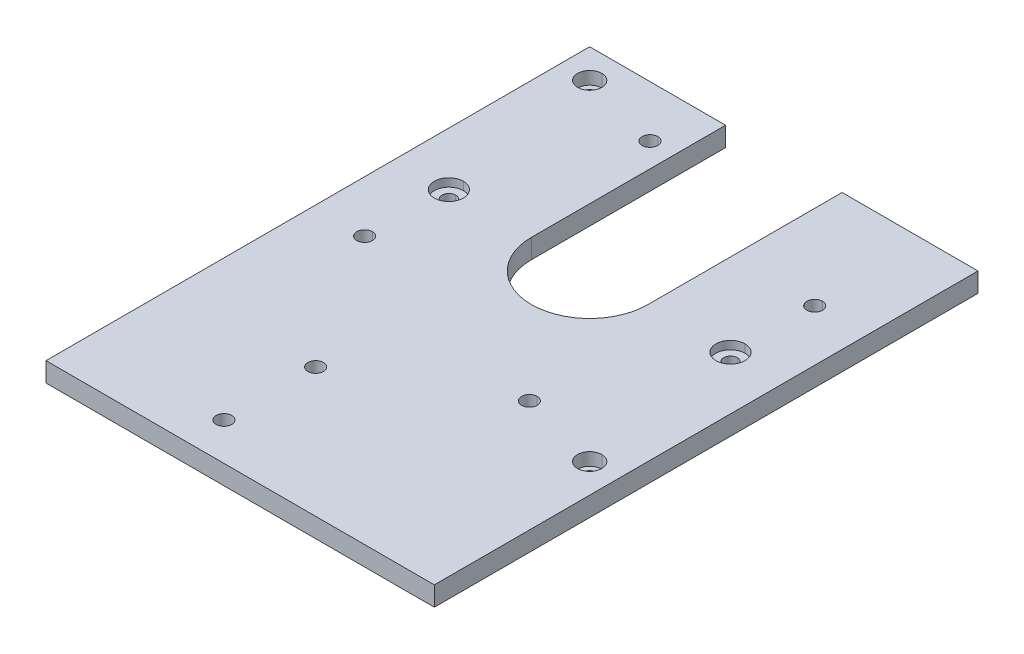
ISO-10303-21;
HEADER;
FILE_DESCRIPTION(('STEP AP214'),'2;1');
FILE_NAME('part.step','',(''),(''),'','','');
FILE_SCHEMA(('AUTOMOTIVE_DESIGN { 1 0 10303 214 1 1 1 1 }'));
ENDSEC;
DATA;
#1=APPLICATION_CONTEXT('core data for automotive mechanical design processes');
#2=APPLICATION_PROTOCOL_DEFINITION('international standard','automotive_design',2000,#1);
#3=PRODUCT_CONTEXT('',#1,'mechanical');
#4=PRODUCT('Part','Part','',(#3));
#5=PRODUCT_RELATED_PRODUCT_CATEGORY('part','',(#4));
#6=PRODUCT_DEFINITION_FORMATION('','',#4);
#7=PRODUCT_DEFINITION_CONTEXT('part definition',#1,'design');
#8=PRODUCT_DEFINITION('design','',#6,#7);
#9=PRODUCT_DEFINITION_SHAPE('','',#8);
#10=(LENGTH_UNIT() NAMED_UNIT(*) SI_UNIT(.MILLI.,.METRE.));
#11=(NAMED_UNIT(*) PLANE_ANGLE_UNIT() SI_UNIT($,.RADIAN.));
#12=(NAMED_UNIT(*) SI_UNIT($,.STERADIAN.) SOLID_ANGLE_UNIT());
#13=UNCERTAINTY_MEASURE_WITH_UNIT(LENGTH_MEASURE(1.E-05),#10,'distance_accuracy_value','');
#14=(GEOMETRIC_REPRESENTATION_CONTEXT(3) GLOBAL_UNCERTAINTY_ASSIGNED_CONTEXT((#13)) GLOBAL_UNIT_ASSIGNED_CONTEXT((#10,
#11,#12)) REPRESENTATION_CONTEXT('',''));
#15=CARTESIAN_POINT('',(0.,0.,0.));
#16=DIRECTION('',(0.,0.,1.));
#17=DIRECTION('',(1.,0.,0.));
#18=AXIS2_PLACEMENT_3D('',#15,#16,#17);
#19=CARTESIAN_POINT('',(48.2981,3.683,0.));
#20=DIRECTION('',(0.,-1.,0.));
#21=DIRECTION('',(0.,0.,-1.));
#22=AXIS2_PLACEMENT_3D('',#19,#20,#21);
#23=PLANE('',#22);
#24=CARTESIAN_POINT('',(46.0502,3.683,0.));
#25=DIRECTION('',(0.,1.,0.));
#26=DIRECTION('',(0.,0.,1.));
#27=AXIS2_PLACEMENT_3D('',#24,#25,#26);
#28=CIRCLE('',#27,4.7625);
#29=CARTESIAN_POINT('',(46.0502,3.683,4.7625));
#30=VERTEX_POINT('',#29);
#31=CARTESIAN_POINT('',(46.0502,3.683,-4.7625));
#32=VERTEX_POINT('',#31);
#33=EDGE_CURVE('E567',#30,#32,#28,.T.);
#34=ORIENTED_EDGE('',*,*,#33,.T.);
#35=CARTESIAN_POINT('',(46.0502,3.683,0.));
#36=DIRECTION('',(0.,1.,0.));
#37=DIRECTION('',(0.,0.,1.));
#38=AXIS2_PLACEMENT_3D('',#35,#36,#37);
#39=CIRCLE('',#38,4.7625);
#40=EDGE_CURVE('E435',#32,#30,#39,.T.);
#41=ORIENTED_EDGE('',*,*,#40,.T.);
#42=EDGE_LOOP('',(#34,#41));
#43=FACE_BOUND('',#42,.T.);
#44=CARTESIAN_POINT('',(46.0502,3.683,0.));
#45=DIRECTION('',(0.,1.,0.));
#46=DIRECTION('',(0.,0.,1.));
#47=AXIS2_PLACEMENT_3D('',#44,#45,#46);
#48=CIRCLE('',#47,2.2479);
#49=CARTESIAN_POINT('',(46.0502,3.683,2.2479));
#50=VERTEX_POINT('',#49);
#51=CARTESIAN_POINT('',(46.0502,3.683,-2.2479));
#52=VERTEX_POINT('',#51);
#53=EDGE_CURVE('E9',#50,#52,#48,.T.);
#54=ORIENTED_EDGE('',*,*,#53,.F.);
#55=CARTESIAN_POINT('',(46.0502,3.683,0.));
#56=DIRECTION('',(0.,1.,0.));
#57=DIRECTION('',(0.,0.,1.));
#58=AXIS2_PLACEMENT_3D('',#55,#56,#57);
#59=CIRCLE('',#58,2.2479);
#60=EDGE_CURVE('E18',#52,#50,#59,.T.);
#61=ORIENTED_EDGE('',*,*,#60,.F.);
#62=EDGE_LOOP('',(#54,#61));
#63=FACE_BOUND('',#62,.T.);
#64=ADVANCED_FACE('F14',(#43,#63),#23,.F.);
#65=CARTESIAN_POINT('',(56.2229,2.1844,53.975));
#66=DIRECTION('',(0.,-1.,0.));
#67=DIRECTION('',(0.,0.,-1.));
#68=AXIS2_PLACEMENT_3D('',#65,#66,#67);
#69=PLANE('',#68);
#70=CARTESIAN_POINT('',(53.975,2.1844,53.975));
#71=DIRECTION('',(0.,1.,0.));
#72=DIRECTION('',(0.,0.,1.));
#73=AXIS2_PLACEMENT_3D('',#70,#71,#72);
#74=CIRCLE('',#73,3.96875);
#75=CARTESIAN_POINT('',(53.975,2.1844,57.94375));
#76=VERTEX_POINT('',#75);
#77=CARTESIAN_POINT('',(53.975,2.1844,50.00625));
#78=VERTEX_POINT('',#77);
#79=EDGE_CURVE('E434',#76,#78,#74,.T.);
#80=ORIENTED_EDGE('',*,*,#79,.T.);
#81=CARTESIAN_POINT('',(53.975,2.1844,53.975));
#82=DIRECTION('',(0.,1.,0.));
#83=DIRECTION('',(0.,0.,1.));
#84=AXIS2_PLACEMENT_3D('',#81,#82,#83);
#85=CIRCLE('',#84,3.96875);
#86=EDGE_CURVE('E433',#78,#76,#85,.T.);
#87=ORIENTED_EDGE('',*,*,#86,.T.);
#88=EDGE_LOOP('',(#80,#87));
#89=FACE_BOUND('',#88,.T.);
#90=CARTESIAN_POINT('',(53.975,2.1844,53.975));
#91=DIRECTION('',(0.,1.,0.));
#92=DIRECTION('',(0.,0.,1.));
#93=AXIS2_PLACEMENT_3D('',#90,#91,#92);
#94=CIRCLE('',#93,2.2479);
#95=CARTESIAN_POINT('',(53.975,2.1844,56.2229));
#96=VERTEX_POINT('',#95);
#97=CARTESIAN_POINT('',(53.975,2.1844,51.7271));
#98=VERTEX_POINT('',#97);
#99=EDGE_CURVE('E339',#96,#98,#94,.T.);
#100=ORIENTED_EDGE('',*,*,#99,.F.);
#101=CARTESIAN_POINT('',(53.975,2.1844,53.975));
#102=DIRECTION('',(0.,1.,0.));
#103=DIRECTION('',(0.,0.,1.));
#104=AXIS2_PLACEMENT_3D('',#101,#102,#103);
#105=CIRCLE('',#104,2.2479);
#106=EDGE_CURVE('E355',#98,#96,#105,.T.);
#107=ORIENTED_EDGE('',*,*,#106,.F.);
#108=EDGE_LOOP('',(#100,#107));
#109=FACE_BOUND('',#108,.T.);
#110=ADVANCED_FACE('F16',(#89,#109),#69,.F.);
#111=CARTESIAN_POINT('',(-51.7271,2.1844,-53.975));
#112=DIRECTION('',(0.,-1.,0.));
#113=DIRECTION('',(0.,0.,-1.));
#114=AXIS2_PLACEMENT_3D('',#111,#112,#113);
#115=PLANE('',#114);
#116=CARTESIAN_POINT('',(-53.975,2.1844,-53.975));
#117=DIRECTION('',(0.,1.,0.));
#118=DIRECTION('',(0.,0.,1.));
#119=AXIS2_PLACEMENT_3D('',#116,#117,#118);
#120=CIRCLE('',#119,3.96875);
#121=CARTESIAN_POINT('',(-53.975,2.1844,-50.00625));
#122=VERTEX_POINT('',#121);
#123=CARTESIAN_POINT('',(-53.975,2.1844,-57.94375));
#124=VERTEX_POINT('',#123);
#125=EDGE_CURVE('E372',#122,#124,#120,.T.);
#126=ORIENTED_EDGE('',*,*,#125,.T.);
#127=CARTESIAN_POINT('',(-53.975,2.1844,-53.975));
#128=DIRECTION('',(0.,1.,0.));
#129=DIRECTION('',(0.,0.,1.));
#130=AXIS2_PLACEMENT_3D('',#127,#128,#129);
#131=CIRCLE('',#130,3.96875);
#132=EDGE_CURVE('E475',#124,#122,#131,.T.);
#133=ORIENTED_EDGE('',*,*,#132,.T.);
#134=EDGE_LOOP('',(#126,#133));
#135=FACE_BOUND('',#134,.T.);
#136=CARTESIAN_POINT('',(-53.975,2.1844,-53.975));
#137=DIRECTION('',(0.,1.,0.));
#138=DIRECTION('',(0.,0.,1.));
#139=AXIS2_PLACEMENT_3D('',#136,#137,#138);
#140=CIRCLE('',#139,2.2479);
#141=CARTESIAN_POINT('',(-53.975,2.1844,-51.7271));
#142=VERTEX_POINT('',#141);
#143=CARTESIAN_POINT('',(-53.975,2.1844,-56.2229));
#144=VERTEX_POINT('',#143);
#145=EDGE_CURVE('E402',#142,#144,#140,.T.);
#146=ORIENTED_EDGE('',*,*,#145,.F.);
#147=CARTESIAN_POINT('',(-53.975,2.1844,-53.975));
#148=DIRECTION('',(0.,1.,0.));
#149=DIRECTION('',(0.,0.,1.));
#150=AXIS2_PLACEMENT_3D('',#147,#148,#149);
#151=CIRCLE('',#150,2.2479);
#152=EDGE_CURVE('E508',#144,#142,#151,.T.);
#153=ORIENTED_EDGE('',*,*,#152,.F.);
#154=EDGE_LOOP('',(#146,#153));
#155=FACE_BOUND('',#154,.T.);
#156=ADVANCED_FACE('F1135',(#135,#155),#115,.F.);
#157=CARTESIAN_POINT('',(-43.8023,3.683,0.));
#158=DIRECTION('',(0.,-1.,0.));
#159=DIRECTION('',(0.,0.,-1.));
#160=AXIS2_PLACEMENT_3D('',#157,#158,#159);
#161=PLANE('',#160);
#162=CARTESIAN_POINT('',(-46.0502,3.683,0.));
#163=DIRECTION('',(0.,1.,0.));
#164=DIRECTION('',(0.,0.,1.));
#165=AXIS2_PLACEMENT_3D('',#162,#163,#164);
#166=CIRCLE('',#165,4.7625);
#167=CARTESIAN_POINT('',(-46.0502,3.683,4.7625));
#168=VERTEX_POINT('',#167);
#169=CARTESIAN_POINT('',(-46.0502,3.683,-4.7625));
#170=VERTEX_POINT('',#169);
#171=EDGE_CURVE('E300',#168,#170,#166,.T.);
#172=ORIENTED_EDGE('',*,*,#171,.T.);
#173=CARTESIAN_POINT('',(-46.0502,3.683,0.));
#174=DIRECTION('',(0.,1.,0.));
#175=DIRECTION('',(0.,0.,1.));
#176=AXIS2_PLACEMENT_3D('',#173,#174,#175);
#177=CIRCLE('',#176,4.7625);
#178=EDGE_CURVE('E295',#170,#168,#177,.T.);
#179=ORIENTED_EDGE('',*,*,#178,.T.);
#180=EDGE_LOOP('',(#172,#179));
#181=FACE_BOUND('',#180,.T.);
#182=CARTESIAN_POINT('',(-46.0502,3.683,0.));
#183=DIRECTION('',(0.,1.,0.));
#184=DIRECTION('',(0.,0.,1.));
#185=AXIS2_PLACEMENT_3D('',#182,#183,#184);
#186=CIRCLE('',#185,2.2479);
#187=CARTESIAN_POINT('',(-46.0502,3.683,2.2479));
#188=VERTEX_POINT('',#187);
#189=CARTESIAN_POINT('',(-46.0502,3.683,-2.2479));
#190=VERTEX_POINT('',#189);
#191=EDGE_CURVE('E509',#188,#190,#186,.T.);
#192=ORIENTED_EDGE('',*,*,#191,.F.);
#193=CARTESIAN_POINT('',(-46.0502,3.683,0.));
#194=DIRECTION('',(0.,1.,0.));
#195=DIRECTION('',(0.,0.,1.));
#196=AXIS2_PLACEMENT_3D('',#193,#194,#195);
#197=CIRCLE('',#196,2.2479);
#198=EDGE_CURVE('E534',#190,#188,#197,.T.);
#199=ORIENTED_EDGE('',*,*,#198,.F.);
#200=EDGE_LOOP('',(#192,#199));
#201=FACE_BOUND('',#200,.T.);
#202=ADVANCED_FACE('F297',(#181,#201),#161,.F.);
#203=CARTESIAN_POINT('',(46.0502,6.35,0.));
#204=DIRECTION('',(0.,1.,0.));
#205=DIRECTION('',(0.,0.,1.));
#206=AXIS2_PLACEMENT_3D('',#203,#204,#205);
#207=CYLINDRICAL_SURFACE('',#206,2.2479);
#208=DIRECTION('',(0.,1.,0.));
#209=VECTOR('',#208,1.);
#210=CARTESIAN_POINT('',(46.0502,6.35,-2.2479));
#211=LINE('',#210,#209);
#212=CARTESIAN_POINT('',(46.0502,0.,-2.2479));
#213=VERTEX_POINT('',#212);
#214=EDGE_CURVE('E335',#213,#52,#211,.T.);
#215=ORIENTED_EDGE('',*,*,#214,.F.);
#216=CARTESIAN_POINT('',(46.0502,0.,0.));
#217=DIRECTION('',(0.,-1.,0.));
#218=DIRECTION('',(0.,0.,-1.));
#219=AXIS2_PLACEMENT_3D('',#216,#217,#218);
#220=CIRCLE('',#219,2.2479);
#221=CARTESIAN_POINT('',(46.0502,0.,2.2479));
#222=VERTEX_POINT('',#221);
#223=EDGE_CURVE('E392',#213,#222,#220,.T.);
#224=ORIENTED_EDGE('',*,*,#223,.T.);
#225=DIRECTION('',(0.,1.,0.));
#226=VECTOR('',#225,1.);
#227=CARTESIAN_POINT('',(46.0502,6.35,2.2479));
#228=LINE('',#227,#226);
#229=EDGE_CURVE('E25',#222,#50,#228,.T.);
#230=ORIENTED_EDGE('',*,*,#229,.T.);
#231=ORIENTED_EDGE('',*,*,#53,.T.);
#232=EDGE_LOOP('',(#215,#224,#230,#231));
#233=FACE_BOUND('',#232,.T.);
#234=ADVANCED_FACE('F1163',(#233),#207,.F.);
#235=CARTESIAN_POINT('',(46.0502,6.35,0.));
#236=DIRECTION('',(0.,1.,0.));
#237=DIRECTION('',(0.,0.,1.));
#238=AXIS2_PLACEMENT_3D('',#235,#236,#237);
#239=CYLINDRICAL_SURFACE('',#238,2.2479);
#240=CARTESIAN_POINT('',(46.0502,0.,0.));
#241=DIRECTION('',(0.,-1.,0.));
#242=DIRECTION('',(0.,0.,-1.));
#243=AXIS2_PLACEMENT_3D('',#240,#241,#242);
#244=CIRCLE('',#243,2.2479);
#245=EDGE_CURVE('E397',#222,#213,#244,.T.);
#246=ORIENTED_EDGE('',*,*,#245,.T.);
#247=ORIENTED_EDGE('',*,*,#214,.T.);
#248=ORIENTED_EDGE('',*,*,#60,.T.);
#249=ORIENTED_EDGE('',*,*,#229,.F.);
#250=EDGE_LOOP('',(#246,#247,#248,#249));
#251=FACE_BOUND('',#250,.T.);
#252=ADVANCED_FACE('F1157',(#251),#239,.F.);
#253=CARTESIAN_POINT('',(53.975,6.35,53.975));
#254=DIRECTION('',(0.,1.,0.));
#255=DIRECTION('',(0.,0.,1.));
#256=AXIS2_PLACEMENT_3D('',#253,#254,#255);
#257=CYLINDRICAL_SURFACE('',#256,2.2479);
#258=DIRECTION('',(0.,1.,0.));
#259=VECTOR('',#258,1.);
#260=CARTESIAN_POINT('',(53.975,6.35,51.7271));
#261=LINE('',#260,#259);
#262=CARTESIAN_POINT('',(53.975,0.,51.7271));
#263=VERTEX_POINT('',#262);
#264=EDGE_CURVE('E398',#263,#98,#261,.T.);
#265=ORIENTED_EDGE('',*,*,#264,.F.);
#266=CARTESIAN_POINT('',(53.975,0.,53.975));
#267=DIRECTION('',(0.,-1.,0.));
#268=DIRECTION('',(0.,0.,-1.));
#269=AXIS2_PLACEMENT_3D('',#266,#267,#268);
#270=CIRCLE('',#269,2.2479);
#271=CARTESIAN_POINT('',(53.975,0.,56.2229));
#272=VERTEX_POINT('',#271);
#273=EDGE_CURVE('E518',#263,#272,#270,.T.);
#274=ORIENTED_EDGE('',*,*,#273,.T.);
#275=DIRECTION('',(0.,1.,0.));
#276=VECTOR('',#275,1.);
#277=CARTESIAN_POINT('',(53.975,6.35,56.2229));
#278=LINE('',#277,#276);
#279=EDGE_CURVE('E352',#272,#96,#278,.T.);
#280=ORIENTED_EDGE('',*,*,#279,.T.);
#281=ORIENTED_EDGE('',*,*,#99,.T.);
#282=EDGE_LOOP('',(#265,#274,#280,#281));
#283=FACE_BOUND('',#282,.T.);
#284=ADVANCED_FACE('F1162',(#283),#257,.F.);
#285=CARTESIAN_POINT('',(53.975,6.35,53.975));
#286=DIRECTION('',(0.,1.,0.));
#287=DIRECTION('',(0.,0.,1.));
#288=AXIS2_PLACEMENT_3D('',#285,#286,#287);
#289=CYLINDRICAL_SURFACE('',#288,2.2479);
#290=CARTESIAN_POINT('',(53.975,0.,53.975));
#291=DIRECTION('',(0.,-1.,0.));
#292=DIRECTION('',(0.,0.,-1.));
#293=AXIS2_PLACEMENT_3D('',#290,#291,#292);
#294=CIRCLE('',#293,2.2479);
#295=EDGE_CURVE('E385',#272,#263,#294,.T.);
#296=ORIENTED_EDGE('',*,*,#295,.T.);
#297=ORIENTED_EDGE('',*,*,#264,.T.);
#298=ORIENTED_EDGE('',*,*,#106,.T.);
#299=ORIENTED_EDGE('',*,*,#279,.F.);
#300=EDGE_LOOP('',(#296,#297,#298,#299));
#301=FACE_BOUND('',#300,.T.);
#302=ADVANCED_FACE('F1309',(#301),#289,.F.);
#303=CARTESIAN_POINT('',(-53.975,6.35,-53.975));
#304=DIRECTION('',(0.,1.,0.));
#305=DIRECTION('',(0.,0.,1.));
#306=AXIS2_PLACEMENT_3D('',#303,#304,#305);
#307=CYLINDRICAL_SURFACE('',#306,2.2479);
#308=DIRECTION('',(0.,1.,0.));
#309=VECTOR('',#308,1.);
#310=CARTESIAN_POINT('',(-53.975,6.35,-56.2229));
#311=LINE('',#310,#309);
#312=CARTESIAN_POINT('',(-53.975,0.,-56.2229));
#313=VERTEX_POINT('',#312);
#314=EDGE_CURVE('E504',#313,#144,#311,.T.);
#315=ORIENTED_EDGE('',*,*,#314,.F.);
#316=CARTESIAN_POINT('',(-53.975,0.,-53.975));
#317=DIRECTION('',(0.,-1.,0.));
#318=DIRECTION('',(0.,0.,-1.));
#319=AXIS2_PLACEMENT_3D('',#316,#317,#318);
#320=CIRCLE('',#319,2.2479);
#321=CARTESIAN_POINT('',(-53.975,0.,-51.7271));
#322=VERTEX_POINT('',#321);
#323=EDGE_CURVE('E386',#313,#322,#320,.T.);
#324=ORIENTED_EDGE('',*,*,#323,.T.);
#325=DIRECTION('',(0.,1.,0.));
#326=VECTOR('',#325,1.);
#327=CARTESIAN_POINT('',(-53.975,6.35,-51.7271));
#328=LINE('',#327,#326);
#329=EDGE_CURVE('E556',#322,#142,#328,.T.);
#330=ORIENTED_EDGE('',*,*,#329,.T.);
#331=ORIENTED_EDGE('',*,*,#145,.T.);
#332=EDGE_LOOP('',(#315,#324,#330,#331));
#333=FACE_BOUND('',#332,.T.);
#334=ADVANCED_FACE('F1050',(#333),#307,.F.);
#335=CARTESIAN_POINT('',(-53.975,6.35,-53.975));
#336=DIRECTION('',(0.,1.,0.));
#337=DIRECTION('',(0.,0.,1.));
#338=AXIS2_PLACEMENT_3D('',#335,#336,#337);
#339=CYLINDRICAL_SURFACE('',#338,2.2479);
#340=CARTESIAN_POINT('',(-53.975,0.,-53.975));
#341=DIRECTION('',(0.,-1.,0.));
#342=DIRECTION('',(0.,0.,-1.));
#343=AXIS2_PLACEMENT_3D('',#340,#341,#342);
#344=CIRCLE('',#343,2.2479);
#345=EDGE_CURVE('E391',#322,#313,#344,.T.);
#346=ORIENTED_EDGE('',*,*,#345,.T.);
#347=ORIENTED_EDGE('',*,*,#314,.T.);
#348=ORIENTED_EDGE('',*,*,#152,.T.);
#349=ORIENTED_EDGE('',*,*,#329,.F.);
#350=EDGE_LOOP('',(#346,#347,#348,#349));
#351=FACE_BOUND('',#350,.T.);
#352=ADVANCED_FACE('F1045',(#351),#339,.F.);
#353=CARTESIAN_POINT('',(-46.0502,6.35,0.));
#354=DIRECTION('',(0.,1.,0.));
#355=DIRECTION('',(0.,0.,1.));
#356=AXIS2_PLACEMENT_3D('',#353,#354,#355);
#357=CYLINDRICAL_SURFACE('',#356,2.2479);
#358=DIRECTION('',(0.,1.,0.));
#359=VECTOR('',#358,1.);
#360=CARTESIAN_POINT('',(-46.0502,6.35,-2.2479));
#361=LINE('',#360,#359);
#362=CARTESIAN_POINT('',(-46.0502,0.,-2.2479));
#363=VERTEX_POINT('',#362);
#364=EDGE_CURVE('E588',#363,#190,#361,.T.);
#365=ORIENTED_EDGE('',*,*,#364,.F.);
#366=CARTESIAN_POINT('',(-46.0502,0.,0.));
#367=DIRECTION('',(0.,-1.,0.));
#368=DIRECTION('',(0.,0.,-1.));
#369=AXIS2_PLACEMENT_3D('',#366,#367,#368);
#370=CIRCLE('',#369,2.2479);
#371=CARTESIAN_POINT('',(-46.0502,0.,2.2479));
#372=VERTEX_POINT('',#371);
#373=EDGE_CURVE('E486',#363,#372,#370,.T.);
#374=ORIENTED_EDGE('',*,*,#373,.T.);
#375=DIRECTION('',(0.,1.,0.));
#376=VECTOR('',#375,1.);
#377=CARTESIAN_POINT('',(-46.0502,6.35,2.2479));
#378=LINE('',#377,#376);
#379=EDGE_CURVE('E530',#372,#188,#378,.T.);
#380=ORIENTED_EDGE('',*,*,#379,.T.);
#381=ORIENTED_EDGE('',*,*,#191,.T.);
#382=EDGE_LOOP('',(#365,#374,#380,#381));
#383=FACE_BOUND('',#382,.T.);
#384=ADVANCED_FACE('F1036',(#383),#357,.F.);
#385=CARTESIAN_POINT('',(-46.0502,6.35,0.));
#386=DIRECTION('',(0.,1.,0.));
#387=DIRECTION('',(0.,0.,1.));
#388=AXIS2_PLACEMENT_3D('',#385,#386,#387);
#389=CYLINDRICAL_SURFACE('',#388,2.2479);
#390=CARTESIAN_POINT('',(-46.0502,0.,0.));
#391=DIRECTION('',(0.,-1.,0.));
#392=DIRECTION('',(0.,0.,-1.));
#393=AXIS2_PLACEMENT_3D('',#390,#391,#392);
#394=CIRCLE('',#393,2.2479);
#395=EDGE_CURVE('E482',#372,#363,#394,.T.);
#396=ORIENTED_EDGE('',*,*,#395,.T.);
#397=ORIENTED_EDGE('',*,*,#364,.T.);
#398=ORIENTED_EDGE('',*,*,#198,.T.);
#399=ORIENTED_EDGE('',*,*,#379,.F.);
#400=EDGE_LOOP('',(#396,#397,#398,#399));
#401=FACE_BOUND('',#400,.T.);
#402=ADVANCED_FACE('F1030',(#401),#389,.F.);
#403=CARTESIAN_POINT('',(46.662331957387,6.35,-26.94050991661));
#404=DIRECTION('',(0.,1.,0.));
#405=DIRECTION('',(0.,0.,1.));
#406=AXIS2_PLACEMENT_3D('',#403,#404,#405);
#407=CYLINDRICAL_SURFACE('',#406,2.5527);
#408=CARTESIAN_POINT('',(46.662331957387,0.,-26.94050991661));
#409=DIRECTION('',(0.,-1.,0.));
#410=DIRECTION('',(0.,0.,-1.));
#411=AXIS2_PLACEMENT_3D('',#408,#409,#410);
#412=CIRCLE('',#411,2.5527);
#413=CARTESIAN_POINT('',(46.662331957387,0.,-24.38780991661));
#414=VERTEX_POINT('',#413);
#415=CARTESIAN_POINT('',(46.662331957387,0.,-29.49320991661));
#416=VERTEX_POINT('',#415);
#417=EDGE_CURVE('E396',#414,#416,#412,.T.);
#418=ORIENTED_EDGE('',*,*,#417,.T.);
#419=DIRECTION('',(0.,1.,0.));
#420=VECTOR('',#419,1.);
#421=CARTESIAN_POINT('',(46.662331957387,6.35,-29.49320991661));
#422=LINE('',#421,#420);
#423=CARTESIAN_POINT('',(46.662331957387,6.35,-29.49320991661));
#424=VERTEX_POINT('',#423);
#425=EDGE_CURVE('E439',#416,#424,#422,.T.);
#426=ORIENTED_EDGE('',*,*,#425,.T.);
#427=CARTESIAN_POINT('',(46.662331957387,6.35,-26.94050991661));
#428=DIRECTION('',(0.,1.,0.));
#429=DIRECTION('',(0.,0.,1.));
#430=AXIS2_PLACEMENT_3D('',#427,#428,#429);
#431=CIRCLE('',#430,2.5527);
#432=CARTESIAN_POINT('',(46.662331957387,6.35,-24.38780991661));
#433=VERTEX_POINT('',#432);
#434=EDGE_CURVE('E553',#424,#433,#431,.T.);
#435=ORIENTED_EDGE('',*,*,#434,.T.);
#436=DIRECTION('',(0.,1.,0.));
#437=VECTOR('',#436,1.);
#438=CARTESIAN_POINT('',(46.662331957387,6.35,-24.38780991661));
#439=LINE('',#438,#437);
#440=EDGE_CURVE('E503',#414,#433,#439,.T.);
#441=ORIENTED_EDGE('',*,*,#440,.F.);
#442=EDGE_LOOP('',(#418,#426,#435,#441));
#443=FACE_BOUND('',#442,.T.);
#444=ADVANCED_FACE('F1035',(#443),#407,.F.);
#445=CARTESIAN_POINT('',(46.662331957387,6.35,-26.94050991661));
#446=DIRECTION('',(0.,1.,0.));
#447=DIRECTION('',(0.,0.,1.));
#448=AXIS2_PLACEMENT_3D('',#445,#446,#447);
#449=CYLINDRICAL_SURFACE('',#448,2.5527);
#450=ORIENTED_EDGE('',*,*,#425,.F.);
#451=CARTESIAN_POINT('',(46.662331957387,0.,-26.94050991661));
#452=DIRECTION('',(0.,-1.,0.));
#453=DIRECTION('',(0.,0.,-1.));
#454=AXIS2_PLACEMENT_3D('',#451,#452,#453);
#455=CIRCLE('',#454,2.5527);
#456=EDGE_CURVE('E458',#416,#414,#455,.T.);
#457=ORIENTED_EDGE('',*,*,#456,.T.);
#458=ORIENTED_EDGE('',*,*,#440,.T.);
#459=CARTESIAN_POINT('',(46.662331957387,6.35,-26.94050991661));
#460=DIRECTION('',(0.,1.,0.));
#461=DIRECTION('',(0.,0.,1.));
#462=AXIS2_PLACEMENT_3D('',#459,#460,#461);
#463=CIRCLE('',#462,2.5527);
#464=EDGE_CURVE('E548',#433,#424,#463,.T.);
#465=ORIENTED_EDGE('',*,*,#464,.T.);
#466=EDGE_LOOP('',(#450,#457,#458,#465));
#467=FACE_BOUND('',#466,.T.);
#468=ADVANCED_FACE('F1009',(#467),#449,.F.);
#469=CARTESIAN_POINT('',(46.0502,6.35,0.));
#470=DIRECTION('',(0.,1.,0.));
#471=DIRECTION('',(0.,0.,1.));
#472=AXIS2_PLACEMENT_3D('',#469,#470,#471);
#473=CYLINDRICAL_SURFACE('',#472,4.7625);
#474=ORIENTED_EDGE('',*,*,#40,.F.);
#475=DIRECTION('',(0.,1.,0.));
#476=VECTOR('',#475,1.);
#477=CARTESIAN_POINT('',(46.0502,6.35,-4.7625));
#478=LINE('',#477,#476);
#479=CARTESIAN_POINT('',(46.0502,6.35,-4.7625));
#480=VERTEX_POINT('',#479);
#481=EDGE_CURVE('E563',#32,#480,#478,.T.);
#482=ORIENTED_EDGE('',*,*,#481,.T.);
#483=CARTESIAN_POINT('',(46.0502,6.35,0.));
#484=DIRECTION('',(0.,1.,0.));
#485=DIRECTION('',(0.,0.,1.));
#486=AXIS2_PLACEMENT_3D('',#483,#484,#485);
#487=CIRCLE('',#486,4.7625);
#488=CARTESIAN_POINT('',(46.0502,6.35,4.7625));
#489=VERTEX_POINT('',#488);
#490=EDGE_CURVE('E597',#480,#489,#487,.T.);
#491=ORIENTED_EDGE('',*,*,#490,.T.);
#492=DIRECTION('',(0.,1.,0.));
#493=VECTOR('',#492,1.);
#494=CARTESIAN_POINT('',(46.0502,6.35,4.7625));
#495=LINE('',#494,#493);
#496=EDGE_CURVE('E440',#30,#489,#495,.T.);
#497=ORIENTED_EDGE('',*,*,#496,.F.);
#498=EDGE_LOOP('',(#474,#482,#491,#497));
#499=FACE_BOUND('',#498,.T.);
#500=ADVANCED_FACE('F1003',(#499),#473,.F.);
#501=CARTESIAN_POINT('',(46.0502,6.35,0.));
#502=DIRECTION('',(0.,1.,0.));
#503=DIRECTION('',(0.,0.,1.));
#504=AXIS2_PLACEMENT_3D('',#501,#502,#503);
#505=CYLINDRICAL_SURFACE('',#504,4.7625);
#506=ORIENTED_EDGE('',*,*,#481,.F.);
#507=ORIENTED_EDGE('',*,*,#33,.F.);
#508=ORIENTED_EDGE('',*,*,#496,.T.);
#509=CARTESIAN_POINT('',(46.0502,6.35,0.));
#510=DIRECTION('',(0.,1.,0.));
#511=DIRECTION('',(0.,0.,1.));
#512=AXIS2_PLACEMENT_3D('',#509,#510,#511);
#513=CIRCLE('',#512,4.7625);
#514=EDGE_CURVE('E601',#489,#480,#513,.T.);
#515=ORIENTED_EDGE('',*,*,#514,.T.);
#516=EDGE_LOOP('',(#506,#507,#508,#515));
#517=FACE_BOUND('',#516,.T.);
#518=ADVANCED_FACE('F1008',(#517),#505,.F.);
#519=CARTESIAN_POINT('',(53.975,6.35,53.975));
#520=DIRECTION('',(0.,1.,0.));
#521=DIRECTION('',(0.,0.,1.));
#522=AXIS2_PLACEMENT_3D('',#519,#520,#521);
#523=CYLINDRICAL_SURFACE('',#522,3.96875);
#524=ORIENTED_EDGE('',*,*,#86,.F.);
#525=DIRECTION('',(0.,1.,0.));
#526=VECTOR('',#525,1.);
#527=CARTESIAN_POINT('',(53.975,6.35,50.00625));
#528=LINE('',#527,#526);
#529=CARTESIAN_POINT('',(53.975,6.35,50.00625));
#530=VERTEX_POINT('',#529);
#531=EDGE_CURVE('E479',#78,#530,#528,.T.);
#532=ORIENTED_EDGE('',*,*,#531,.T.);
#533=CARTESIAN_POINT('',(53.975,6.35,53.975));
#534=DIRECTION('',(0.,1.,0.));
#535=DIRECTION('',(0.,0.,1.));
#536=AXIS2_PLACEMENT_3D('',#533,#534,#535);
#537=CIRCLE('',#536,3.96875);
#538=CARTESIAN_POINT('',(53.975,6.35,57.94375));
#539=VERTEX_POINT('',#538);
#540=EDGE_CURVE('E346',#530,#539,#537,.T.);
#541=ORIENTED_EDGE('',*,*,#540,.T.);
#542=DIRECTION('',(0.,1.,0.));
#543=VECTOR('',#542,1.);
#544=CARTESIAN_POINT('',(53.975,6.35,57.94375));
#545=LINE('',#544,#543);
#546=EDGE_CURVE('E429',#76,#539,#545,.T.);
#547=ORIENTED_EDGE('',*,*,#546,.F.);
#548=EDGE_LOOP('',(#524,#532,#541,#547));
#549=FACE_BOUND('',#548,.T.);
#550=ADVANCED_FACE('F756',(#549),#523,.F.);
#551=CARTESIAN_POINT('',(53.975,6.35,53.975));
#552=DIRECTION('',(0.,1.,0.));
#553=DIRECTION('',(0.,0.,1.));
#554=AXIS2_PLACEMENT_3D('',#551,#552,#553);
#555=CYLINDRICAL_SURFACE('',#554,3.96875);
#556=ORIENTED_EDGE('',*,*,#531,.F.);
#557=ORIENTED_EDGE('',*,*,#79,.F.);
#558=ORIENTED_EDGE('',*,*,#546,.T.);
#559=CARTESIAN_POINT('',(53.975,6.35,53.975));
#560=DIRECTION('',(0.,1.,0.));
#561=DIRECTION('',(0.,0.,1.));
#562=AXIS2_PLACEMENT_3D('',#559,#560,#561);
#563=CIRCLE('',#562,3.96875);
#564=EDGE_CURVE('E350',#539,#530,#563,.T.);
#565=ORIENTED_EDGE('',*,*,#564,.T.);
#566=EDGE_LOOP('',(#556,#557,#558,#565));
#567=FACE_BOUND('',#566,.T.);
#568=ADVANCED_FACE('F750',(#567),#555,.F.);
#569=CARTESIAN_POINT('',(26.94000618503,6.35,46.661459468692));
#570=DIRECTION('',(0.,1.,0.));
#571=DIRECTION('',(0.,0.,1.));
#572=AXIS2_PLACEMENT_3D('',#569,#570,#571);
#573=CYLINDRICAL_SURFACE('',#572,2.5527);
#574=CARTESIAN_POINT('',(26.94000618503,0.,46.661459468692));
#575=DIRECTION('',(0.,-1.,0.));
#576=DIRECTION('',(0.,0.,-1.));
#577=AXIS2_PLACEMENT_3D('',#574,#575,#576);
#578=CIRCLE('',#577,2.5527);
#579=CARTESIAN_POINT('',(26.94000618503,0.,49.214159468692));
#580=VERTEX_POINT('',#579);
#581=CARTESIAN_POINT('',(26.94000618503,0.,44.108759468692));
#582=VERTEX_POINT('',#581);
#583=EDGE_CURVE('E328',#580,#582,#578,.T.);
#584=ORIENTED_EDGE('',*,*,#583,.T.);
#585=DIRECTION('',(0.,1.,0.));
#586=VECTOR('',#585,1.);
#587=CARTESIAN_POINT('',(26.94000618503,6.35,44.108759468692));
#588=LINE('',#587,#586);
#589=CARTESIAN_POINT('',(26.94000618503,6.35,44.108759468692));
#590=VERTEX_POINT('',#589);
#591=EDGE_CURVE('E492',#582,#590,#588,.T.);
#592=ORIENTED_EDGE('',*,*,#591,.T.);
#593=CARTESIAN_POINT('',(26.94000618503,6.35,46.661459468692));
#594=DIRECTION('',(0.,1.,0.));
#595=DIRECTION('',(0.,0.,1.));
#596=AXIS2_PLACEMENT_3D('',#593,#594,#595);
#597=CIRCLE('',#596,2.5527);
#598=CARTESIAN_POINT('',(26.94000618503,6.35,49.214159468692));
#599=VERTEX_POINT('',#598);
#600=EDGE_CURVE('E461',#590,#599,#597,.T.);
#601=ORIENTED_EDGE('',*,*,#600,.T.);
#602=DIRECTION('',(0.,1.,0.));
#603=VECTOR('',#602,1.);
#604=CARTESIAN_POINT('',(26.94000618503,6.35,49.214159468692));
#605=LINE('',#604,#603);
#606=EDGE_CURVE('E284',#580,#599,#605,.T.);
#607=ORIENTED_EDGE('',*,*,#606,.F.);
#608=EDGE_LOOP('',(#584,#592,#601,#607));
#609=FACE_BOUND('',#608,.T.);
#610=ADVANCED_FACE('F1084',(#609),#573,.F.);
#611=CARTESIAN_POINT('',(26.94000618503,6.35,46.661459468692));
#612=DIRECTION('',(0.,1.,0.));
#613=DIRECTION('',(0.,0.,1.));
#614=AXIS2_PLACEMENT_3D('',#611,#612,#613);
#615=CYLINDRICAL_SURFACE('',#614,2.5527);
#616=ORIENTED_EDGE('',*,*,#591,.F.);
#617=CARTESIAN_POINT('',(26.94000618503,0.,46.661459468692));
#618=DIRECTION('',(0.,-1.,0.));
#619=DIRECTION('',(0.,0.,-1.));
#620=AXIS2_PLACEMENT_3D('',#617,#618,#619);
#621=CIRCLE('',#620,2.5527);
#622=EDGE_CURVE('E382',#582,#580,#621,.T.);
#623=ORIENTED_EDGE('',*,*,#622,.T.);
#624=ORIENTED_EDGE('',*,*,#606,.T.);
#625=CARTESIAN_POINT('',(26.94000618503,6.35,46.661459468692));
#626=DIRECTION('',(0.,1.,0.));
#627=DIRECTION('',(0.,0.,1.));
#628=AXIS2_PLACEMENT_3D('',#625,#626,#627);
#629=CIRCLE('',#628,2.5527);
#630=EDGE_CURVE('E351',#599,#590,#629,.T.);
#631=ORIENTED_EDGE('',*,*,#630,.T.);
#632=EDGE_LOOP('',(#616,#623,#624,#631));
#633=FACE_BOUND('',#632,.T.);
#634=ADVANCED_FACE('F1175',(#633),#615,.F.);
#635=CARTESIAN_POINT('',(-26.94051,6.35,-46.66233210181));
#636=DIRECTION('',(0.,1.,0.));
#637=DIRECTION('',(0.,0.,1.));
#638=AXIS2_PLACEMENT_3D('',#635,#636,#637);
#639=CYLINDRICAL_SURFACE('',#638,2.5527);
#640=CARTESIAN_POINT('',(-26.94051,0.,-46.66233210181));
#641=DIRECTION('',(0.,-1.,0.));
#642=DIRECTION('',(0.,0.,-1.));
#643=AXIS2_PLACEMENT_3D('',#640,#641,#642);
#644=CIRCLE('',#643,2.5527);
#645=CARTESIAN_POINT('',(-26.94051,0.,-44.10963210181));
#646=VERTEX_POINT('',#645);
#647=CARTESIAN_POINT('',(-26.94051,0.,-49.21503210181));
#648=VERTEX_POINT('',#647);
#649=EDGE_CURVE('E390',#646,#648,#644,.T.);
#650=ORIENTED_EDGE('',*,*,#649,.T.);
#651=DIRECTION('',(0.,1.,0.));
#652=VECTOR('',#651,1.);
#653=CARTESIAN_POINT('',(-26.94051,6.35,-49.21503210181));
#654=LINE('',#653,#652);
#655=CARTESIAN_POINT('',(-26.94051,6.35,-49.21503210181));
#656=VERTEX_POINT('',#655);
#657=EDGE_CURVE('E88',#648,#656,#654,.T.);
#658=ORIENTED_EDGE('',*,*,#657,.T.);
#659=CARTESIAN_POINT('',(-26.94051,6.35,-46.66233210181));
#660=DIRECTION('',(0.,1.,0.));
#661=DIRECTION('',(0.,0.,1.));
#662=AXIS2_PLACEMENT_3D('',#659,#660,#661);
#663=CIRCLE('',#662,2.5527);
#664=CARTESIAN_POINT('',(-26.94051,6.35,-44.10963210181));
#665=VERTEX_POINT('',#664);
#666=EDGE_CURVE('E376',#656,#665,#663,.T.);
#667=ORIENTED_EDGE('',*,*,#666,.T.);
#668=DIRECTION('',(0.,1.,0.));
#669=VECTOR('',#668,1.);
#670=CARTESIAN_POINT('',(-26.94051,6.35,-44.10963210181));
#671=LINE('',#670,#669);
#672=EDGE_CURVE('E71',#646,#665,#671,.T.);
#673=ORIENTED_EDGE('',*,*,#672,.F.);
#674=EDGE_LOOP('',(#650,#658,#667,#673));
#675=FACE_BOUND('',#674,.T.);
#676=ADVANCED_FACE('F1222',(#675),#639,.F.);
#677=CARTESIAN_POINT('',(-26.94051,6.35,-46.66233210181));
#678=DIRECTION('',(0.,1.,0.));
#679=DIRECTION('',(0.,0.,1.));
#680=AXIS2_PLACEMENT_3D('',#677,#678,#679);
#681=CYLINDRICAL_SURFACE('',#680,2.5527);
#682=ORIENTED_EDGE('',*,*,#657,.F.);
#683=CARTESIAN_POINT('',(-26.94051,0.,-46.66233210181));
#684=DIRECTION('',(0.,-1.,0.));
#685=DIRECTION('',(0.,0.,-1.));
#686=AXIS2_PLACEMENT_3D('',#683,#684,#685);
#687=CIRCLE('',#686,2.5527);
#688=EDGE_CURVE('E443',#648,#646,#687,.T.);
#689=ORIENTED_EDGE('',*,*,#688,.T.);
#690=ORIENTED_EDGE('',*,*,#672,.T.);
#691=CARTESIAN_POINT('',(-26.94051,6.35,-46.66233210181));
#692=DIRECTION('',(0.,1.,0.));
#693=DIRECTION('',(0.,0.,1.));
#694=AXIS2_PLACEMENT_3D('',#691,#692,#693);
#695=CIRCLE('',#694,2.5527);
#696=EDGE_CURVE('E464',#665,#656,#695,.T.);
#697=ORIENTED_EDGE('',*,*,#696,.T.);
#698=EDGE_LOOP('',(#682,#689,#690,#697));
#699=FACE_BOUND('',#698,.T.);
#700=ADVANCED_FACE('F1239',(#699),#681,.F.);
#701=CARTESIAN_POINT('',(-53.975,6.35,-53.975));
#702=DIRECTION('',(0.,1.,0.));
#703=DIRECTION('',(0.,0.,1.));
#704=AXIS2_PLACEMENT_3D('',#701,#702,#703);
#705=CYLINDRICAL_SURFACE('',#704,3.96875);
#706=ORIENTED_EDGE('',*,*,#132,.F.);
#707=DIRECTION('',(0.,1.,0.));
#708=VECTOR('',#707,1.);
#709=CARTESIAN_POINT('',(-53.975,6.35,-57.94375));
#710=LINE('',#709,#708);
#711=CARTESIAN_POINT('',(-53.975,6.35,-57.94375));
#712=VERTEX_POINT('',#711);
#713=EDGE_CURVE('E304',#124,#712,#710,.T.);
#714=ORIENTED_EDGE('',*,*,#713,.T.);
#715=CARTESIAN_POINT('',(-53.975,6.35,-53.975));
#716=DIRECTION('',(0.,1.,0.));
#717=DIRECTION('',(0.,0.,1.));
#718=AXIS2_PLACEMENT_3D('',#715,#716,#717);
#719=CIRCLE('',#718,3.96875);
#720=CARTESIAN_POINT('',(-53.975,6.35,-50.00625));
#721=VERTEX_POINT('',#720);
#722=EDGE_CURVE('E340',#712,#721,#719,.T.);
#723=ORIENTED_EDGE('',*,*,#722,.T.);
#724=DIRECTION('',(0.,1.,0.));
#725=VECTOR('',#724,1.);
#726=CARTESIAN_POINT('',(-53.975,6.35,-50.00625));
#727=LINE('',#726,#725);
#728=EDGE_CURVE('E478',#122,#721,#727,.T.);
#729=ORIENTED_EDGE('',*,*,#728,.F.);
#730=EDGE_LOOP('',(#706,#714,#723,#729));
#731=FACE_BOUND('',#730,.T.);
#732=ADVANCED_FACE('F1105',(#731),#705,.F.);
#733=CARTESIAN_POINT('',(-53.975,6.35,-53.975));
#734=DIRECTION('',(0.,1.,0.));
#735=DIRECTION('',(0.,0.,1.));
#736=AXIS2_PLACEMENT_3D('',#733,#734,#735);
#737=CYLINDRICAL_SURFACE('',#736,3.96875);
#738=ORIENTED_EDGE('',*,*,#713,.F.);
#739=ORIENTED_EDGE('',*,*,#125,.F.);
#740=ORIENTED_EDGE('',*,*,#728,.T.);
#741=CARTESIAN_POINT('',(-53.975,6.35,-53.975));
#742=DIRECTION('',(0.,1.,0.));
#743=DIRECTION('',(0.,0.,1.));
#744=AXIS2_PLACEMENT_3D('',#741,#742,#743);
#745=CIRCLE('',#744,3.96875);
#746=EDGE_CURVE('E344',#721,#712,#745,.T.);
#747=ORIENTED_EDGE('',*,*,#746,.T.);
#748=EDGE_LOOP('',(#738,#739,#740,#747));
#749=FACE_BOUND('',#748,.T.);
#750=ADVANCED_FACE('F1100',(#749),#737,.F.);
#751=CARTESIAN_POINT('',(-46.0502,6.35,0.));
#752=DIRECTION('',(0.,1.,0.));
#753=DIRECTION('',(0.,0.,1.));
#754=AXIS2_PLACEMENT_3D('',#751,#752,#753);
#755=CYLINDRICAL_SURFACE('',#754,4.7625);
#756=ORIENTED_EDGE('',*,*,#178,.F.);
#757=DIRECTION('',(0.,1.,0.));
#758=VECTOR('',#757,1.);
#759=CARTESIAN_POINT('',(-46.0502,6.35,-4.7625));
#760=LINE('',#759,#758);
#761=CARTESIAN_POINT('',(-46.0502,6.35,-4.7625));
#762=VERTEX_POINT('',#761);
#763=EDGE_CURVE('E317',#170,#762,#760,.T.);
#764=ORIENTED_EDGE('',*,*,#763,.T.);
#765=CARTESIAN_POINT('',(-46.0502,6.35,0.));
#766=DIRECTION('',(0.,1.,0.));
#767=DIRECTION('',(0.,0.,1.));
#768=AXIS2_PLACEMENT_3D('',#765,#766,#767);
#769=CIRCLE('',#768,4.7625);
#770=CARTESIAN_POINT('',(-46.0502,6.35,4.7625));
#771=VERTEX_POINT('',#770);
#772=EDGE_CURVE('E310',#762,#771,#769,.T.);
#773=ORIENTED_EDGE('',*,*,#772,.T.);
#774=DIRECTION('',(0.,1.,0.));
#775=VECTOR('',#774,1.);
#776=CARTESIAN_POINT('',(-46.0502,6.35,4.7625));
#777=LINE('',#776,#775);
#778=EDGE_CURVE('E305',#168,#771,#777,.T.);
#779=ORIENTED_EDGE('',*,*,#778,.F.);
#780=EDGE_LOOP('',(#756,#764,#773,#779));
#781=FACE_BOUND('',#780,.T.);
#782=ADVANCED_FACE('F308',(#781),#755,.F.);
#783=CARTESIAN_POINT('',(-46.0502,6.35,0.));
#784=DIRECTION('',(0.,1.,0.));
#785=DIRECTION('',(0.,0.,1.));
#786=AXIS2_PLACEMENT_3D('',#783,#784,#785);
#787=CYLINDRICAL_SURFACE('',#786,4.7625);
#788=ORIENTED_EDGE('',*,*,#763,.F.);
#789=ORIENTED_EDGE('',*,*,#171,.F.);
#790=ORIENTED_EDGE('',*,*,#778,.T.);
#791=CARTESIAN_POINT('',(-46.0502,6.35,0.));
#792=DIRECTION('',(0.,1.,0.));
#793=DIRECTION('',(0.,0.,1.));
#794=AXIS2_PLACEMENT_3D('',#791,#792,#793);
#795=CIRCLE('',#794,4.7625);
#796=EDGE_CURVE('E345',#771,#762,#795,.T.);
#797=ORIENTED_EDGE('',*,*,#796,.T.);
#798=EDGE_LOOP('',(#788,#789,#790,#797));
#799=FACE_BOUND('',#798,.T.);
#800=ADVANCED_FACE('F316',(#799),#787,.F.);
#801=CARTESIAN_POINT('',(-17.6,0.,72.));
#802=DIRECTION('',(0.,-1.,0.));
#803=DIRECTION('',(1.,0.,0.));
#804=AXIS2_PLACEMENT_3D('',#801,#802,#803);
#805=CYLINDRICAL_SURFACE('',#804,2.5527);
#806=DIRECTION('',(0.,1.,0.));
#807=VECTOR('',#806,1.);
#808=CARTESIAN_POINT('',(-15.0473,0.,72.));
#809=LINE('',#808,#807);
#810=CARTESIAN_POINT('',(-15.0473,0.,72.));
#811=VERTEX_POINT('',#810);
#812=CARTESIAN_POINT('',(-15.0473,6.35,72.));
#813=VERTEX_POINT('',#812);
#814=EDGE_CURVE('E324',#811,#813,#809,.T.);
#815=ORIENTED_EDGE('',*,*,#814,.T.);
#816=CARTESIAN_POINT('',(-17.6,6.35,72.));
#817=DIRECTION('',(0.,-1.,0.));
#818=DIRECTION('',(1.,0.,0.));
#819=AXIS2_PLACEMENT_3D('',#816,#817,#818);
#820=CIRCLE('',#819,2.5527);
#821=EDGE_CURVE('E446',#813,#813,#820,.T.);
#822=ORIENTED_EDGE('',*,*,#821,.F.);
#823=ORIENTED_EDGE('',*,*,#814,.F.);
#824=CARTESIAN_POINT('',(-17.6,0.,72.));
#825=DIRECTION('',(0.,-1.,0.));
#826=DIRECTION('',(1.,0.,0.));
#827=AXIS2_PLACEMENT_3D('',#824,#825,#826);
#828=CIRCLE('',#827,2.5527);
#829=EDGE_CURVE('E487',#811,#811,#828,.T.);
#830=ORIENTED_EDGE('',*,*,#829,.T.);
#831=EDGE_LOOP('',(#815,#822,#823,#830));
#832=FACE_BOUND('',#831,.T.);
#833=ADVANCED_FACE('F1022',(#832),#805,.F.);
#834=CARTESIAN_POINT('',(-17.6,0.,102.));
#835=DIRECTION('',(0.,-1.,0.));
#836=DIRECTION('',(1.,0.,0.));
#837=AXIS2_PLACEMENT_3D('',#834,#835,#836);
#838=CYLINDRICAL_SURFACE('',#837,2.5527);
#839=DIRECTION('',(0.,1.,0.));
#840=VECTOR('',#839,1.);
#841=CARTESIAN_POINT('',(-15.0473,0.,102.));
#842=LINE('',#841,#840);
#843=CARTESIAN_POINT('',(-15.0473,0.,102.));
#844=VERTEX_POINT('',#843);
#845=CARTESIAN_POINT('',(-15.0473,6.35,102.));
#846=VERTEX_POINT('',#845);
#847=EDGE_CURVE('E409',#844,#846,#842,.T.);
#848=ORIENTED_EDGE('',*,*,#847,.T.);
#849=CARTESIAN_POINT('',(-17.6,6.35,102.));
#850=DIRECTION('',(0.,-1.,0.));
#851=DIRECTION('',(1.,0.,0.));
#852=AXIS2_PLACEMENT_3D('',#849,#850,#851);
#853=CIRCLE('',#852,2.5527);
#854=EDGE_CURVE('E510',#846,#846,#853,.T.);
#855=ORIENTED_EDGE('',*,*,#854,.F.);
#856=ORIENTED_EDGE('',*,*,#847,.F.);
#857=CARTESIAN_POINT('',(-17.6,0.,102.));
#858=DIRECTION('',(0.,-1.,0.));
#859=DIRECTION('',(1.,0.,0.));
#860=AXIS2_PLACEMENT_3D('',#857,#858,#859);
#861=CIRCLE('',#860,2.5527);
#862=EDGE_CURVE('E573',#844,#844,#861,.T.);
#863=ORIENTED_EDGE('',*,*,#862,.T.);
#864=EDGE_LOOP('',(#848,#855,#856,#863));
#865=FACE_BOUND('',#864,.T.);
#866=ADVANCED_FACE('F1211',(#865),#838,.F.);
#867=CARTESIAN_POINT('',(-46.65990472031,6.35,26.939108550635));
#868=DIRECTION('',(0.,1.,0.));
#869=DIRECTION('',(0.,0.,1.));
#870=AXIS2_PLACEMENT_3D('',#867,#868,#869);
#871=CYLINDRICAL_SURFACE('',#870,2.5527);
#872=CARTESIAN_POINT('',(-46.65990472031,0.,26.939108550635));
#873=DIRECTION('',(0.,-1.,0.));
#874=DIRECTION('',(0.,0.,-1.));
#875=AXIS2_PLACEMENT_3D('',#872,#873,#874);
#876=CIRCLE('',#875,2.5527);
#877=CARTESIAN_POINT('',(-46.65990472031,0.,29.491808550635));
#878=VERTEX_POINT('',#877);
#879=CARTESIAN_POINT('',(-46.65990472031,0.,24.386408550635));
#880=VERTEX_POINT('',#879);
#881=EDGE_CURVE('E469',#878,#880,#876,.T.);
#882=ORIENTED_EDGE('',*,*,#881,.T.);
#883=DIRECTION('',(0.,1.,0.));
#884=VECTOR('',#883,1.);
#885=CARTESIAN_POINT('',(-46.65990472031,6.35,24.386408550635));
#886=LINE('',#885,#884);
#887=CARTESIAN_POINT('',(-46.65990472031,6.35,24.386408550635));
#888=VERTEX_POINT('',#887);
#889=EDGE_CURVE('E333',#880,#888,#886,.T.);
#890=ORIENTED_EDGE('',*,*,#889,.T.);
#891=CARTESIAN_POINT('',(-46.65990472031,6.35,26.939108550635));
#892=DIRECTION('',(0.,1.,0.));
#893=DIRECTION('',(0.,0.,1.));
#894=AXIS2_PLACEMENT_3D('',#891,#892,#893);
#895=CIRCLE('',#894,2.5527);
#896=CARTESIAN_POINT('',(-46.65990472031,6.35,29.491808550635));
#897=VERTEX_POINT('',#896);
#898=EDGE_CURVE('E529',#888,#897,#895,.T.);
#899=ORIENTED_EDGE('',*,*,#898,.T.);
#900=DIRECTION('',(0.,1.,0.));
#901=VECTOR('',#900,1.);
#902=CARTESIAN_POINT('',(-46.65990472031,6.35,29.491808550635));
#903=LINE('',#902,#901);
#904=EDGE_CURVE('E412',#878,#897,#903,.T.);
#905=ORIENTED_EDGE('',*,*,#904,.F.);
#906=EDGE_LOOP('',(#882,#890,#899,#905));
#907=FACE_BOUND('',#906,.T.);
#908=ADVANCED_FACE('F1118',(#907),#871,.F.);
#909=CARTESIAN_POINT('',(-46.65990472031,6.35,26.939108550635));
#910=DIRECTION('',(0.,1.,0.));
#911=DIRECTION('',(0.,0.,1.));
#912=AXIS2_PLACEMENT_3D('',#909,#910,#911);
#913=CYLINDRICAL_SURFACE('',#912,2.5527);
#914=ORIENTED_EDGE('',*,*,#889,.F.);
#915=CARTESIAN_POINT('',(-46.65990472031,0.,26.939108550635));
#916=DIRECTION('',(0.,-1.,0.));
#917=DIRECTION('',(0.,0.,-1.));
#918=AXIS2_PLACEMENT_3D('',#915,#916,#917);
#919=CIRCLE('',#918,2.5527);
#920=EDGE_CURVE('E547',#880,#878,#919,.T.);
#921=ORIENTED_EDGE('',*,*,#920,.T.);
#922=ORIENTED_EDGE('',*,*,#904,.T.);
#923=CARTESIAN_POINT('',(-46.65990472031,6.35,26.939108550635));
#924=DIRECTION('',(0.,1.,0.));
#925=DIRECTION('',(0.,0.,1.));
#926=AXIS2_PLACEMENT_3D('',#923,#924,#925);
#927=CIRCLE('',#926,2.5527);
#928=EDGE_CURVE('E514',#897,#888,#927,.T.);
#929=ORIENTED_EDGE('',*,*,#928,.T.);
#930=EDGE_LOOP('',(#914,#921,#922,#929));
#931=FACE_BOUND('',#930,.T.);
#932=ADVANCED_FACE('F1113',(#931),#913,.F.);
#933=CARTESIAN_POINT('',(63.5,6.35,63.5));
#934=DIRECTION('',(-1.,0.,0.));
#935=DIRECTION('',(0.,0.,1.));
#936=AXIS2_PLACEMENT_3D('',#933,#934,#935);
#937=PLANE('',#936);
#938=DIRECTION('',(0.,0.,-1.));
#939=VECTOR('',#938,1.);
#940=CARTESIAN_POINT('',(63.5,0.,63.5));
#941=LINE('',#940,#939);
#942=CARTESIAN_POINT('',(63.5,0.,114.3));
#943=VERTEX_POINT('',#942);
#944=CARTESIAN_POINT('',(63.5,0.,-63.5));
#945=VERTEX_POINT('',#944);
#946=EDGE_CURVE('E428',#943,#945,#941,.T.);
#947=ORIENTED_EDGE('',*,*,#946,.T.);
#948=DIRECTION('',(0.,-1.,0.));
#949=VECTOR('',#948,1.);
#950=CARTESIAN_POINT('',(63.5,6.35,-63.5));
#951=LINE('',#950,#949);
#952=CARTESIAN_POINT('',(63.5,6.35,-63.5));
#953=VERTEX_POINT('',#952);
#954=EDGE_CURVE('E454',#953,#945,#951,.T.);
#955=ORIENTED_EDGE('',*,*,#954,.F.);
#956=DIRECTION('',(0.,0.,-1.));
#957=VECTOR('',#956,1.);
#958=CARTESIAN_POINT('',(63.5,6.35,63.5));
#959=LINE('',#958,#957);
#960=CARTESIAN_POINT('',(63.5,6.35,114.3));
#961=VERTEX_POINT('',#960);
#962=EDGE_CURVE('E420',#961,#953,#959,.T.);
#963=ORIENTED_EDGE('',*,*,#962,.F.);
#964=DIRECTION('',(0.,1.,0.));
#965=VECTOR('',#964,1.);
#966=CARTESIAN_POINT('',(63.5,6.35,114.3));
#967=LINE('',#966,#965);
#968=EDGE_CURVE('E330',#943,#961,#967,.T.);
#969=ORIENTED_EDGE('',*,*,#968,.F.);
#970=EDGE_LOOP('',(#947,#955,#963,#969));
#971=FACE_BOUND('',#970,.T.);
#972=ADVANCED_FACE('F691',(#971),#937,.F.);
#973=CARTESIAN_POINT('',(0.,0.,114.3));
#974=DIRECTION('',(0.,0.,1.));
#975=DIRECTION('',(1.,0.,0.));
#976=AXIS2_PLACEMENT_3D('',#973,#974,#975);
#977=PLANE('',#976);
#978=DIRECTION('',(0.,-1.,0.));
#979=VECTOR('',#978,1.);
#980=CARTESIAN_POINT('',(-63.5,6.35,114.3));
#981=LINE('',#980,#979);
#982=CARTESIAN_POINT('',(-63.5,6.35,114.3));
#983=VERTEX_POINT('',#982);
#984=CARTESIAN_POINT('',(-63.5,0.,114.3));
#985=VERTEX_POINT('',#984);
#986=EDGE_CURVE('E334',#983,#985,#981,.T.);
#987=ORIENTED_EDGE('',*,*,#986,.T.);
#988=DIRECTION('',(1.,0.,0.));
#989=VECTOR('',#988,1.);
#990=CARTESIAN_POINT('',(-63.5,0.,114.3));
#991=LINE('',#990,#989);
#992=EDGE_CURVE('E470',#985,#943,#991,.T.);
#993=ORIENTED_EDGE('',*,*,#992,.T.);
#994=ORIENTED_EDGE('',*,*,#968,.T.);
#995=DIRECTION('',(-1.,0.,0.));
#996=VECTOR('',#995,1.);
#997=CARTESIAN_POINT('',(-63.5,6.35,114.3));
#998=LINE('',#997,#996);
#999=EDGE_CURVE('E425',#961,#983,#998,.T.);
#1000=ORIENTED_EDGE('',*,*,#999,.T.);
#1001=EDGE_LOOP('',(#987,#993,#994,#1000));
#1002=FACE_BOUND('',#1001,.T.);
#1003=ADVANCED_FACE('F682',(#1002),#977,.T.);
#1004=CARTESIAN_POINT('',(-63.5,6.35,63.5));
#1005=DIRECTION('',(1.,0.,0.));
#1006=DIRECTION('',(0.,1.,0.));
#1007=AXIS2_PLACEMENT_3D('',#1004,#1005,#1006);
#1008=PLANE('',#1007);
#1009=DIRECTION('',(0.,0.,1.));
#1010=VECTOR('',#1009,1.);
#1011=CARTESIAN_POINT('',(-63.5,0.,63.5));
#1012=LINE('',#1011,#1010);
#1013=CARTESIAN_POINT('',(-63.5,0.,-63.5));
#1014=VERTEX_POINT('',#1013);
#1015=EDGE_CURVE('E465',#1014,#985,#1012,.T.);
#1016=ORIENTED_EDGE('',*,*,#1015,.T.);
#1017=ORIENTED_EDGE('',*,*,#986,.F.);
#1018=DIRECTION('',(0.,0.,1.));
#1019=VECTOR('',#1018,1.);
#1020=CARTESIAN_POINT('',(-63.5,6.35,63.5));
#1021=LINE('',#1020,#1019);
#1022=CARTESIAN_POINT('',(-63.5,6.35,-63.5));
#1023=VERTEX_POINT('',#1022);
#1024=EDGE_CURVE('E417',#1023,#983,#1021,.T.);
#1025=ORIENTED_EDGE('',*,*,#1024,.F.);
#1026=DIRECTION('',(0.,-1.,0.));
#1027=VECTOR('',#1026,1.);
#1028=CARTESIAN_POINT('',(-63.5,6.35,-63.5));
#1029=LINE('',#1028,#1027);
#1030=EDGE_CURVE('E368',#1023,#1014,#1029,.T.);
#1031=ORIENTED_EDGE('',*,*,#1030,.T.);
#1032=EDGE_LOOP('',(#1016,#1017,#1025,#1031));
#1033=FACE_BOUND('',#1032,.T.);
#1034=ADVANCED_FACE('F699',(#1033),#1008,.F.);
#1035=CARTESIAN_POINT('',(-63.5,6.35,-63.5));
#1036=DIRECTION('',(0.,0.,1.));
#1037=DIRECTION('',(1.,0.,0.));
#1038=AXIS2_PLACEMENT_3D('',#1035,#1036,#1037);
#1039=PLANE('',#1038);
#1040=DIRECTION('',(0.,1.,0.));
#1041=VECTOR('',#1040,1.);
#1042=CARTESIAN_POINT('',(-19.05,0.,-63.5));
#1043=LINE('',#1042,#1041);
#1044=CARTESIAN_POINT('',(-19.05,0.,-63.5));
#1045=VERTEX_POINT('',#1044);
#1046=CARTESIAN_POINT('',(-19.05,6.35,-63.5));
#1047=VERTEX_POINT('',#1046);
#1048=EDGE_CURVE('E450',#1045,#1047,#1043,.T.);
#1049=ORIENTED_EDGE('',*,*,#1048,.F.);
#1050=DIRECTION('',(-1.,0.,0.));
#1051=VECTOR('',#1050,1.);
#1052=CARTESIAN_POINT('',(-63.5,0.,-63.5));
#1053=LINE('',#1052,#1051);
#1054=EDGE_CURVE('E408',#1045,#1014,#1053,.T.);
#1055=ORIENTED_EDGE('',*,*,#1054,.T.);
#1056=ORIENTED_EDGE('',*,*,#1030,.F.);
#1057=DIRECTION('',(-1.,0.,0.));
#1058=VECTOR('',#1057,1.);
#1059=CARTESIAN_POINT('',(-63.5,6.35,-63.5));
#1060=LINE('',#1059,#1058);
#1061=EDGE_CURVE('E413',#1047,#1023,#1060,.T.);
#1062=ORIENTED_EDGE('',*,*,#1061,.F.);
#1063=EDGE_LOOP('',(#1049,#1055,#1056,#1062));
#1064=FACE_BOUND('',#1063,.T.);
#1065=ADVANCED_FACE('F705',(#1064),#1039,.F.);
#1066=CARTESIAN_POINT('',(-19.05,0.,0.));
#1067=DIRECTION('',(1.,0.,0.));
#1068=DIRECTION('',(0.,1.,0.));
#1069=AXIS2_PLACEMENT_3D('',#1066,#1067,#1068);
#1070=PLANE('',#1069);
#1071=DIRECTION('',(0.,0.,-1.));
#1072=VECTOR('',#1071,1.);
#1073=CARTESIAN_POINT('',(-19.05,6.35,0.));
#1074=LINE('',#1073,#1072);
#1075=CARTESIAN_POINT('',(-19.05,6.35,0.));
#1076=VERTEX_POINT('',#1075);
#1077=EDGE_CURVE('E474',#1076,#1047,#1074,.T.);
#1078=ORIENTED_EDGE('',*,*,#1077,.F.);
#1079=DIRECTION('',(0.,1.,0.));
#1080=VECTOR('',#1079,1.);
#1081=CARTESIAN_POINT('',(-19.05,0.,0.));
#1082=LINE('',#1081,#1080);
#1083=CARTESIAN_POINT('',(-19.05,0.,0.));
#1084=VERTEX_POINT('',#1083);
#1085=EDGE_CURVE('E640',#1084,#1076,#1082,.T.);
#1086=ORIENTED_EDGE('',*,*,#1085,.F.);
#1087=DIRECTION('',(0.,0.,-1.));
#1088=VECTOR('',#1087,1.);
#1089=CARTESIAN_POINT('',(-19.05,0.,0.));
#1090=LINE('',#1089,#1088);
#1091=EDGE_CURVE('E403',#1084,#1045,#1090,.T.);
#1092=ORIENTED_EDGE('',*,*,#1091,.T.);
#1093=ORIENTED_EDGE('',*,*,#1048,.T.);
#1094=EDGE_LOOP('',(#1078,#1086,#1092,#1093));
#1095=FACE_BOUND('',#1094,.T.);
#1096=ADVANCED_FACE('F709',(#1095),#1070,.T.);
#1097=CARTESIAN_POINT('',(-63.5,6.35,-63.5));
#1098=DIRECTION('',(0.,0.,1.));
#1099=DIRECTION('',(1.,0.,0.));
#1100=AXIS2_PLACEMENT_3D('',#1097,#1098,#1099);
#1101=PLANE('',#1100);
#1102=DIRECTION('',(0.,1.,0.));
#1103=VECTOR('',#1102,1.);
#1104=CARTESIAN_POINT('',(19.05,0.,-63.5));
#1105=LINE('',#1104,#1103);
#1106=CARTESIAN_POINT('',(19.05,0.,-63.5));
#1107=VERTEX_POINT('',#1106);
#1108=CARTESIAN_POINT('',(19.05,6.35,-63.5));
#1109=VERTEX_POINT('',#1108);
#1110=EDGE_CURVE('E357',#1107,#1109,#1105,.T.);
#1111=ORIENTED_EDGE('',*,*,#1110,.T.);
#1112=DIRECTION('',(-1.,0.,0.));
#1113=VECTOR('',#1112,1.);
#1114=CARTESIAN_POINT('',(-63.5,6.35,-63.5));
#1115=LINE('',#1114,#1113);
#1116=EDGE_CURVE('E424',#953,#1109,#1115,.T.);
#1117=ORIENTED_EDGE('',*,*,#1116,.F.);
#1118=ORIENTED_EDGE('',*,*,#954,.T.);
#1119=DIRECTION('',(-1.,0.,0.));
#1120=VECTOR('',#1119,1.);
#1121=CARTESIAN_POINT('',(-63.5,0.,-63.5));
#1122=LINE('',#1121,#1120);
#1123=EDGE_CURVE('E407',#945,#1107,#1122,.T.);
#1124=ORIENTED_EDGE('',*,*,#1123,.T.);
#1125=EDGE_LOOP('',(#1111,#1117,#1118,#1124));
#1126=FACE_BOUND('',#1125,.T.);
#1127=ADVANCED_FACE('F725',(#1126),#1101,.F.);
#1128=CARTESIAN_POINT('',(0.,0.,0.));
#1129=DIRECTION('',(0.,-1.,0.));
#1130=DIRECTION('',(0.,0.,-1.));
#1131=AXIS2_PLACEMENT_3D('',#1128,#1129,#1130);
#1132=PLANE('',#1131);
#1133=ORIENTED_EDGE('',*,*,#417,.F.);
#1134=ORIENTED_EDGE('',*,*,#456,.F.);
#1135=EDGE_LOOP('',(#1133,#1134));
#1136=FACE_BOUND('',#1135,.T.);
#1137=ORIENTED_EDGE('',*,*,#245,.F.);
#1138=ORIENTED_EDGE('',*,*,#223,.F.);
#1139=EDGE_LOOP('',(#1137,#1138));
#1140=FACE_BOUND('',#1139,.T.);
#1141=ORIENTED_EDGE('',*,*,#295,.F.);
#1142=ORIENTED_EDGE('',*,*,#273,.F.);
#1143=EDGE_LOOP('',(#1141,#1142));
#1144=FACE_BOUND('',#1143,.T.);
#1145=ORIENTED_EDGE('',*,*,#583,.F.);
#1146=ORIENTED_EDGE('',*,*,#622,.F.);
#1147=EDGE_LOOP('',(#1145,#1146));
#1148=FACE_BOUND('',#1147,.T.);
#1149=ORIENTED_EDGE('',*,*,#649,.F.);
#1150=ORIENTED_EDGE('',*,*,#688,.F.);
#1151=EDGE_LOOP('',(#1149,#1150));
#1152=FACE_BOUND('',#1151,.T.);
#1153=ORIENTED_EDGE('',*,*,#345,.F.);
#1154=ORIENTED_EDGE('',*,*,#323,.F.);
#1155=EDGE_LOOP('',(#1153,#1154));
#1156=FACE_BOUND('',#1155,.T.);
#1157=ORIENTED_EDGE('',*,*,#395,.F.);
#1158=ORIENTED_EDGE('',*,*,#373,.F.);
#1159=EDGE_LOOP('',(#1157,#1158));
#1160=FACE_BOUND('',#1159,.T.);
#1161=ORIENTED_EDGE('',*,*,#829,.F.);
#1162=EDGE_LOOP('',(#1161));
#1163=FACE_BOUND('',#1162,.T.);
#1164=ORIENTED_EDGE('',*,*,#862,.F.);
#1165=EDGE_LOOP('',(#1164));
#1166=FACE_BOUND('',#1165,.T.);
#1167=ORIENTED_EDGE('',*,*,#881,.F.);
#1168=ORIENTED_EDGE('',*,*,#920,.F.);
#1169=EDGE_LOOP('',(#1167,#1168));
#1170=FACE_BOUND('',#1169,.T.);
#1171=ORIENTED_EDGE('',*,*,#1054,.F.);
#1172=ORIENTED_EDGE('',*,*,#1091,.F.);
#1173=CARTESIAN_POINT('',(0.,0.,0.));
#1174=DIRECTION('',(0.,1.,0.));
#1175=DIRECTION('',(0.,0.,1.));
#1176=AXIS2_PLACEMENT_3D('',#1173,#1174,#1175);
#1177=CIRCLE('',#1176,19.05);
#1178=CARTESIAN_POINT('',(0.,0.,19.05));
#1179=VERTEX_POINT('',#1178);
#1180=EDGE_CURVE('E552',#1084,#1179,#1177,.T.);
#1181=ORIENTED_EDGE('',*,*,#1180,.T.);
#1182=CARTESIAN_POINT('',(0.,0.,0.));
#1183=DIRECTION('',(0.,1.,0.));
#1184=DIRECTION('',(0.,0.,1.));
#1185=AXIS2_PLACEMENT_3D('',#1182,#1183,#1184);
#1186=CIRCLE('',#1185,19.05);
#1187=CARTESIAN_POINT('',(19.05,0.,0.));
#1188=VERTEX_POINT('',#1187);
#1189=EDGE_CURVE('E523',#1179,#1188,#1186,.T.);
#1190=ORIENTED_EDGE('',*,*,#1189,.T.);
#1191=DIRECTION('',(0.,0.,1.));
#1192=VECTOR('',#1191,1.);
#1193=CARTESIAN_POINT('',(19.05,0.,0.));
#1194=LINE('',#1193,#1192);
#1195=EDGE_CURVE('E361',#1107,#1188,#1194,.T.);
#1196=ORIENTED_EDGE('',*,*,#1195,.F.);
#1197=ORIENTED_EDGE('',*,*,#1123,.F.);
#1198=ORIENTED_EDGE('',*,*,#946,.F.);
#1199=ORIENTED_EDGE('',*,*,#992,.F.);
#1200=ORIENTED_EDGE('',*,*,#1015,.F.);
#1201=EDGE_LOOP('',(#1171,#1172,#1181,#1190,#1196,#1197,#1198,#1199,#1200));
#1202=FACE_BOUND('',#1201,.T.);
#1203=ADVANCED_FACE('F688',(#1136,#1140,#1144,#1148,#1152,#1156,#1160,#1163,#1166,#1170,#1202),
#1132,.T.);
#1204=CARTESIAN_POINT('',(0.,0.,0.));
#1205=DIRECTION('',(0.,1.,0.));
#1206=DIRECTION('',(0.,0.,1.));
#1207=AXIS2_PLACEMENT_3D('',#1204,#1205,#1206);
#1208=CYLINDRICAL_SURFACE('',#1207,19.05);
#1209=DIRECTION('',(0.,1.,0.));
#1210=VECTOR('',#1209,1.);
#1211=CARTESIAN_POINT('',(0.,0.,19.05));
#1212=LINE('',#1211,#1210);
#1213=CARTESIAN_POINT('',(0.,6.35,19.05));
#1214=VERTEX_POINT('',#1213);
#1215=EDGE_CURVE('E519',#1179,#1214,#1212,.T.);
#1216=ORIENTED_EDGE('',*,*,#1215,.F.);
#1217=ORIENTED_EDGE('',*,*,#1180,.F.);
#1218=ORIENTED_EDGE('',*,*,#1085,.T.);
#1219=CARTESIAN_POINT('',(0.,6.35,0.));
#1220=DIRECTION('',(0.,1.,0.));
#1221=DIRECTION('',(0.,0.,1.));
#1222=AXIS2_PLACEMENT_3D('',#1219,#1220,#1221);
#1223=CIRCLE('',#1222,19.05);
#1224=EDGE_CURVE('E471',#1076,#1214,#1223,.T.);
#1225=ORIENTED_EDGE('',*,*,#1224,.T.);
#1226=EDGE_LOOP('',(#1216,#1217,#1218,#1225));
#1227=FACE_BOUND('',#1226,.T.);
#1228=ADVANCED_FACE('F714',(#1227),#1208,.F.);
#1229=CARTESIAN_POINT('',(0.,6.35,0.));
#1230=DIRECTION('',(0.,-1.,0.));
#1231=DIRECTION('',(0.,0.,-1.));
#1232=AXIS2_PLACEMENT_3D('',#1229,#1230,#1231);
#1233=PLANE('',#1232);
#1234=ORIENTED_EDGE('',*,*,#434,.F.);
#1235=ORIENTED_EDGE('',*,*,#464,.F.);
#1236=EDGE_LOOP('',(#1234,#1235));
#1237=FACE_BOUND('',#1236,.T.);
#1238=ORIENTED_EDGE('',*,*,#490,.F.);
#1239=ORIENTED_EDGE('',*,*,#514,.F.);
#1240=EDGE_LOOP('',(#1238,#1239));
#1241=FACE_BOUND('',#1240,.T.);
#1242=ORIENTED_EDGE('',*,*,#540,.F.);
#1243=ORIENTED_EDGE('',*,*,#564,.F.);
#1244=EDGE_LOOP('',(#1242,#1243));
#1245=FACE_BOUND('',#1244,.T.);
#1246=ORIENTED_EDGE('',*,*,#600,.F.);
#1247=ORIENTED_EDGE('',*,*,#630,.F.);
#1248=EDGE_LOOP('',(#1246,#1247));
#1249=FACE_BOUND('',#1248,.T.);
#1250=ORIENTED_EDGE('',*,*,#666,.F.);
#1251=ORIENTED_EDGE('',*,*,#696,.F.);
#1252=EDGE_LOOP('',(#1250,#1251));
#1253=FACE_BOUND('',#1252,.T.);
#1254=ORIENTED_EDGE('',*,*,#722,.F.);
#1255=ORIENTED_EDGE('',*,*,#746,.F.);
#1256=EDGE_LOOP('',(#1254,#1255));
#1257=FACE_BOUND('',#1256,.T.);
#1258=ORIENTED_EDGE('',*,*,#772,.F.);
#1259=ORIENTED_EDGE('',*,*,#796,.F.);
#1260=EDGE_LOOP('',(#1258,#1259));
#1261=FACE_BOUND('',#1260,.T.);
#1262=ORIENTED_EDGE('',*,*,#821,.T.);
#1263=EDGE_LOOP('',(#1262));
#1264=FACE_BOUND('',#1263,.T.);
#1265=ORIENTED_EDGE('',*,*,#854,.T.);
#1266=EDGE_LOOP('',(#1265));
#1267=FACE_BOUND('',#1266,.T.);
#1268=ORIENTED_EDGE('',*,*,#898,.F.);
#1269=ORIENTED_EDGE('',*,*,#928,.F.);
#1270=EDGE_LOOP('',(#1268,#1269));
#1271=FACE_BOUND('',#1270,.T.);
#1272=ORIENTED_EDGE('',*,*,#1061,.T.);
#1273=ORIENTED_EDGE('',*,*,#1024,.T.);
#1274=ORIENTED_EDGE('',*,*,#999,.F.);
#1275=ORIENTED_EDGE('',*,*,#962,.T.);
#1276=ORIENTED_EDGE('',*,*,#1116,.T.);
#1277=DIRECTION('',(0.,0.,1.));
#1278=VECTOR('',#1277,1.);
#1279=CARTESIAN_POINT('',(19.05,6.35,0.));
#1280=LINE('',#1279,#1278);
#1281=CARTESIAN_POINT('',(19.05,6.35,0.));
#1282=VERTEX_POINT('',#1281);
#1283=EDGE_CURVE('E362',#1109,#1282,#1280,.T.);
#1284=ORIENTED_EDGE('',*,*,#1283,.T.);
#1285=CARTESIAN_POINT('',(0.,6.35,0.));
#1286=DIRECTION('',(0.,1.,0.));
#1287=DIRECTION('',(0.,0.,1.));
#1288=AXIS2_PLACEMENT_3D('',#1285,#1286,#1287);
#1289=CIRCLE('',#1288,19.05);
#1290=EDGE_CURVE('E380',#1214,#1282,#1289,.T.);
#1291=ORIENTED_EDGE('',*,*,#1290,.F.);
#1292=ORIENTED_EDGE('',*,*,#1224,.F.);
#1293=ORIENTED_EDGE('',*,*,#1077,.T.);
#1294=EDGE_LOOP('',(#1272,#1273,#1274,#1275,#1276,#1284,#1291,#1292,#1293));
#1295=FACE_BOUND('',#1294,.T.);
#1296=ADVANCED_FACE('F695',(#1237,#1241,#1245,#1249,#1253,#1257,#1261,#1264,#1267,#1271,#1295),
#1233,.F.);
#1297=CARTESIAN_POINT('',(19.05,0.,0.));
#1298=DIRECTION('',(-1.,0.,0.));
#1299=DIRECTION('',(0.,0.,1.));
#1300=AXIS2_PLACEMENT_3D('',#1297,#1298,#1299);
#1301=PLANE('',#1300);
#1302=ORIENTED_EDGE('',*,*,#1283,.F.);
#1303=ORIENTED_EDGE('',*,*,#1110,.F.);
#1304=ORIENTED_EDGE('',*,*,#1195,.T.);
#1305=DIRECTION('',(0.,1.,0.));
#1306=VECTOR('',#1305,1.);
#1307=CARTESIAN_POINT('',(19.05,0.,0.));
#1308=LINE('',#1307,#1306);
#1309=EDGE_CURVE('E377',#1188,#1282,#1308,.T.);
#1310=ORIENTED_EDGE('',*,*,#1309,.T.);
#1311=EDGE_LOOP('',(#1302,#1303,#1304,#1310));
#1312=FACE_BOUND('',#1311,.T.);
#1313=ADVANCED_FACE('F722',(#1312),#1301,.T.);
#1314=CARTESIAN_POINT('',(0.,0.,0.));
#1315=DIRECTION('',(0.,1.,0.));
#1316=DIRECTION('',(0.,0.,1.));
#1317=AXIS2_PLACEMENT_3D('',#1314,#1315,#1316);
#1318=CYLINDRICAL_SURFACE('',#1317,19.05);
#1319=ORIENTED_EDGE('',*,*,#1189,.F.);
#1320=ORIENTED_EDGE('',*,*,#1215,.T.);
#1321=ORIENTED_EDGE('',*,*,#1290,.T.);
#1322=ORIENTED_EDGE('',*,*,#1309,.F.);
#1323=EDGE_LOOP('',(#1319,#1320,#1321,#1322));
#1324=FACE_BOUND('',#1323,.T.);
#1325=ADVANCED_FACE('F719',(#1324),#1318,.F.);
#1326=CLOSED_SHELL('',(#64,#110,#156,#202,#234,#252,#284,#302,#334,#352,#384,#402,#444,#468,
#500,#518,#550,#568,#610,#634,#676,#700,#732,#750,#782,#800,#833,#866,#908,#932,#972,#1003,
#1034,#1065,#1096,#1127,#1203,#1228,#1296,#1313,#1325));
#1327=MANIFOLD_SOLID_BREP('B1',#1326);
#1328=ADVANCED_BREP_SHAPE_REPRESENTATION('',(#18,#1327),#14);
#1329=SHAPE_DEFINITION_REPRESENTATION(#9,#1328);
ENDSEC;
END-ISO-10303-21;
